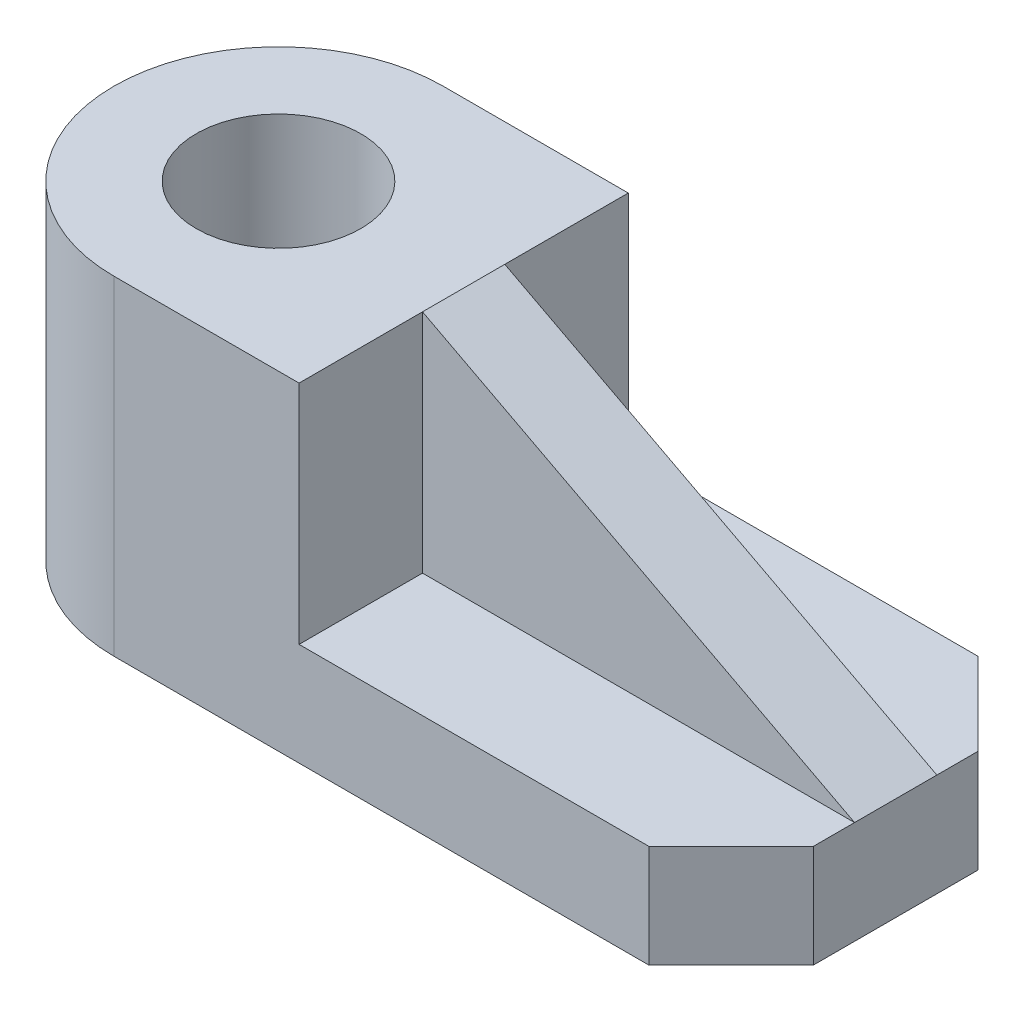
ISO-10303-21;
HEADER;
FILE_DESCRIPTION(('STEP AP214'),'2;1');
FILE_NAME('part.step','',(''),(''),'','','');
FILE_SCHEMA(('AUTOMOTIVE_DESIGN { 1 0 10303 214 1 1 1 1 }'));
ENDSEC;
DATA;
#1=APPLICATION_CONTEXT('core data for automotive mechanical design processes');
#2=APPLICATION_PROTOCOL_DEFINITION('international standard','automotive_design',2000,#1);
#3=PRODUCT_CONTEXT('',#1,'mechanical');
#4=PRODUCT('Part','Part','',(#3));
#5=PRODUCT_RELATED_PRODUCT_CATEGORY('part','',(#4));
#6=PRODUCT_DEFINITION_FORMATION('','',#4);
#7=PRODUCT_DEFINITION_CONTEXT('part definition',#1,'design');
#8=PRODUCT_DEFINITION('design','',#6,#7);
#9=PRODUCT_DEFINITION_SHAPE('','',#8);
#10=(LENGTH_UNIT() NAMED_UNIT(*) SI_UNIT(.MILLI.,.METRE.));
#11=(NAMED_UNIT(*) PLANE_ANGLE_UNIT() SI_UNIT($,.RADIAN.));
#12=(NAMED_UNIT(*) SI_UNIT($,.STERADIAN.) SOLID_ANGLE_UNIT());
#13=UNCERTAINTY_MEASURE_WITH_UNIT(LENGTH_MEASURE(1.E-05),#10,'distance_accuracy_value','');
#14=(GEOMETRIC_REPRESENTATION_CONTEXT(3) GLOBAL_UNCERTAINTY_ASSIGNED_CONTEXT((#13)) GLOBAL_UNIT_ASSIGNED_CONTEXT((#10,
#11,#12)) REPRESENTATION_CONTEXT('',''));
#15=CARTESIAN_POINT('',(0.,0.,0.));
#16=DIRECTION('',(0.,0.,1.));
#17=DIRECTION('',(1.,0.,0.));
#18=AXIS2_PLACEMENT_3D('',#15,#16,#17);
#19=CARTESIAN_POINT('',(0.,10.,0.));
#20=DIRECTION('',(0.,-1.,0.));
#21=DIRECTION('',(0.,0.,-1.));
#22=AXIS2_PLACEMENT_3D('',#19,#20,#21);
#23=PLANE('',#22);
#24=DIRECTION('',(0.,0.,-1.));
#25=VECTOR('',#24,1.);
#26=CARTESIAN_POINT('',(60.,10.,-16.));
#27=LINE('',#26,#25);
#28=CARTESIAN_POINT('',(60.,10.,-4.));
#29=VERTEX_POINT('',#28);
#30=CARTESIAN_POINT('',(60.,10.,-7.99999999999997));
#31=VERTEX_POINT('',#30);
#32=EDGE_CURVE('E158',#29,#31,#27,.T.);
#33=ORIENTED_EDGE('',*,*,#32,.T.);
#34=DIRECTION('',(0.707106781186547,0.,0.707106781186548));
#35=VECTOR('',#34,1.);
#36=CARTESIAN_POINT('',(52.,10.,-16.));
#37=LINE('',#36,#35);
#38=CARTESIAN_POINT('',(52.,10.,-16.));
#39=VERTEX_POINT('',#38);
#40=EDGE_CURVE('E218',#31,#39,#37,.F.);
#41=ORIENTED_EDGE('',*,*,#40,.T.);
#42=DIRECTION('',(-1.,0.,0.));
#43=VECTOR('',#42,1.);
#44=CARTESIAN_POINT('',(0.,10.,-16.));
#45=LINE('',#44,#43);
#46=CARTESIAN_POINT('',(18.,10.,-16.));
#47=VERTEX_POINT('',#46);
#48=EDGE_CURVE('E175',#39,#47,#45,.T.);
#49=ORIENTED_EDGE('',*,*,#48,.T.);
#50=DIRECTION('',(0.,0.,-1.));
#51=VECTOR('',#50,1.);
#52=CARTESIAN_POINT('',(18.,10.,-16.));
#53=LINE('',#52,#51);
#54=CARTESIAN_POINT('',(18.,10.,-4.));
#55=VERTEX_POINT('',#54);
#56=EDGE_CURVE('E161',#55,#47,#53,.T.);
#57=ORIENTED_EDGE('',*,*,#56,.F.);
#58=DIRECTION('',(-1.,0.,0.));
#59=VECTOR('',#58,1.);
#60=CARTESIAN_POINT('',(0.,10.,-4.));
#61=LINE('',#60,#59);
#62=EDGE_CURVE('E149',#29,#55,#61,.T.);
#63=ORIENTED_EDGE('',*,*,#62,.F.);
#64=EDGE_LOOP('',(#33,#41,#49,#57,#63));
#65=FACE_BOUND('',#64,.T.);
#66=ADVANCED_FACE('F49',(#65),#23,.F.);
#67=CARTESIAN_POINT('',(18.,32.,-16.));
#68=DIRECTION('',(-1.,0.,0.));
#69=DIRECTION('',(0.,0.,1.));
#70=AXIS2_PLACEMENT_3D('',#67,#68,#69);
#71=PLANE('',#70);
#72=DIRECTION('',(0.,1.,0.));
#73=VECTOR('',#72,1.);
#74=CARTESIAN_POINT('',(18.,32.,-4.));
#75=LINE('',#74,#73);
#76=CARTESIAN_POINT('',(18.,32.,-4.));
#77=VERTEX_POINT('',#76);
#78=EDGE_CURVE('E151',#55,#77,#75,.T.);
#79=ORIENTED_EDGE('',*,*,#78,.F.);
#80=ORIENTED_EDGE('',*,*,#56,.T.);
#81=DIRECTION('',(0.,-1.,0.));
#82=VECTOR('',#81,1.);
#83=CARTESIAN_POINT('',(18.,32.,-16.));
#84=LINE('',#83,#82);
#85=CARTESIAN_POINT('',(18.,32.,-16.));
#86=VERTEX_POINT('',#85);
#87=EDGE_CURVE('E230',#86,#47,#84,.T.);
#88=ORIENTED_EDGE('',*,*,#87,.F.);
#89=DIRECTION('',(0.,0.,-1.));
#90=VECTOR('',#89,1.);
#91=CARTESIAN_POINT('',(18.,32.,-16.));
#92=LINE('',#91,#90);
#93=EDGE_CURVE('E254',#77,#86,#92,.T.);
#94=ORIENTED_EDGE('',*,*,#93,.F.);
#95=EDGE_LOOP('',(#79,#80,#88,#94));
#96=FACE_BOUND('',#95,.T.);
#97=ADVANCED_FACE('F310',(#96),#71,.F.);
#98=DIRECTION('',(1.,0.,0.));
#99=VECTOR('',#98,1.);
#100=CARTESIAN_POINT('',(60.,10.,16.));
#101=LINE('',#100,#99);
#102=CARTESIAN_POINT('',(18.,10.,16.));
#103=VERTEX_POINT('',#102);
#104=CARTESIAN_POINT('',(52.,10.,16.));
#105=VERTEX_POINT('',#104);
#106=EDGE_CURVE('E171',#103,#105,#101,.T.);
#107=ORIENTED_EDGE('',*,*,#106,.T.);
#108=DIRECTION('',(-0.707106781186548,0.,0.707106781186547));
#109=VECTOR('',#108,1.);
#110=CARTESIAN_POINT('',(60.,10.,7.99999999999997));
#111=LINE('',#110,#109);
#112=CARTESIAN_POINT('',(60.,10.,7.99999999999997));
#113=VERTEX_POINT('',#112);
#114=EDGE_CURVE('E11',#105,#113,#111,.F.);
#115=ORIENTED_EDGE('',*,*,#114,.T.);
#116=CARTESIAN_POINT('',(60.,10.,4.));
#117=VERTEX_POINT('',#116);
#118=EDGE_CURVE('E170',#113,#117,#27,.T.);
#119=ORIENTED_EDGE('',*,*,#118,.T.);
#120=DIRECTION('',(-1.,0.,0.));
#121=VECTOR('',#120,1.);
#122=CARTESIAN_POINT('',(0.,10.,4.));
#123=LINE('',#122,#121);
#124=CARTESIAN_POINT('',(18.,10.,4.));
#125=VERTEX_POINT('',#124);
#126=EDGE_CURVE('E144',#117,#125,#123,.T.);
#127=ORIENTED_EDGE('',*,*,#126,.T.);
#128=EDGE_CURVE('E265',#103,#125,#53,.T.);
#129=ORIENTED_EDGE('',*,*,#128,.F.);
#130=EDGE_LOOP('',(#107,#115,#119,#127,#129));
#131=FACE_BOUND('',#130,.T.);
#132=ADVANCED_FACE('F274',(#131),#23,.F.);
#133=CARTESIAN_POINT('',(0.,10.,0.));
#134=DIRECTION('',(0.,-1.,0.));
#135=DIRECTION('',(0.,0.,-1.));
#136=AXIS2_PLACEMENT_3D('',#133,#134,#135);
#137=CYLINDRICAL_SURFACE('',#136,16.);
#138=DIRECTION('',(0.,-1.,0.));
#139=VECTOR('',#138,1.);
#140=CARTESIAN_POINT('',(0.,10.,16.));
#141=LINE('',#140,#139);
#142=CARTESIAN_POINT('',(0.,32.,16.));
#143=VERTEX_POINT('',#142);
#144=CARTESIAN_POINT('',(0.,0.,16.));
#145=VERTEX_POINT('',#144);
#146=EDGE_CURVE('E198',#143,#145,#141,.T.);
#147=ORIENTED_EDGE('',*,*,#146,.F.);
#148=CARTESIAN_POINT('',(0.,32.,0.));
#149=DIRECTION('',(0.,1.,0.));
#150=DIRECTION('',(0.,0.,-1.));
#151=AXIS2_PLACEMENT_3D('',#148,#149,#150);
#152=CIRCLE('',#151,16.);
#153=CARTESIAN_POINT('',(0.,32.,-16.));
#154=VERTEX_POINT('',#153);
#155=EDGE_CURVE('E247',#154,#143,#152,.T.);
#156=ORIENTED_EDGE('',*,*,#155,.F.);
#157=DIRECTION('',(0.,-1.,0.));
#158=VECTOR('',#157,1.);
#159=CARTESIAN_POINT('',(0.,10.,-16.));
#160=LINE('',#159,#158);
#161=CARTESIAN_POINT('',(0.,0.,-16.));
#162=VERTEX_POINT('',#161);
#163=EDGE_CURVE('E182',#154,#162,#160,.T.);
#164=ORIENTED_EDGE('',*,*,#163,.T.);
#165=CARTESIAN_POINT('',(0.,0.,0.));
#166=DIRECTION('',(0.,1.,0.));
#167=DIRECTION('',(0.,0.,-1.));
#168=AXIS2_PLACEMENT_3D('',#165,#166,#167);
#169=CIRCLE('',#168,16.);
#170=EDGE_CURVE('E183',#162,#145,#169,.T.);
#171=ORIENTED_EDGE('',*,*,#170,.T.);
#172=EDGE_LOOP('',(#147,#156,#164,#171));
#173=FACE_BOUND('',#172,.T.);
#174=ADVANCED_FACE('F246',(#173),#137,.T.);
#175=CARTESIAN_POINT('',(60.,10.,16.));
#176=DIRECTION('',(0.,0.,-1.));
#177=DIRECTION('',(-1.,0.,0.));
#178=AXIS2_PLACEMENT_3D('',#175,#176,#177);
#179=PLANE('',#178);
#180=DIRECTION('',(1.,0.,0.));
#181=VECTOR('',#180,1.);
#182=CARTESIAN_POINT('',(60.,0.,16.));
#183=LINE('',#182,#181);
#184=CARTESIAN_POINT('',(52.,0.,16.));
#185=VERTEX_POINT('',#184);
#186=EDGE_CURVE('E186',#145,#185,#183,.T.);
#187=ORIENTED_EDGE('',*,*,#186,.T.);
#188=DIRECTION('',(0.,1.,0.));
#189=VECTOR('',#188,1.);
#190=CARTESIAN_POINT('',(52.,10.,16.));
#191=LINE('',#190,#189);
#192=EDGE_CURVE('E59',#185,#105,#191,.T.);
#193=ORIENTED_EDGE('',*,*,#192,.T.);
#194=ORIENTED_EDGE('',*,*,#106,.F.);
#195=DIRECTION('',(0.,-1.,0.));
#196=VECTOR('',#195,1.);
#197=CARTESIAN_POINT('',(18.,32.,16.));
#198=LINE('',#197,#196);
#199=CARTESIAN_POINT('',(18.,32.,16.));
#200=VERTEX_POINT('',#199);
#201=EDGE_CURVE('E187',#200,#103,#198,.T.);
#202=ORIENTED_EDGE('',*,*,#201,.F.);
#203=DIRECTION('',(1.,0.,0.));
#204=VECTOR('',#203,1.);
#205=CARTESIAN_POINT('',(18.,32.,16.));
#206=LINE('',#205,#204);
#207=EDGE_CURVE('E243',#143,#200,#206,.T.);
#208=ORIENTED_EDGE('',*,*,#207,.F.);
#209=ORIENTED_EDGE('',*,*,#146,.T.);
#210=EDGE_LOOP('',(#187,#193,#194,#202,#208,#209));
#211=FACE_BOUND('',#210,.T.);
#212=ADVANCED_FACE('F239',(#211),#179,.F.);
#213=CARTESIAN_POINT('',(60.,10.,-16.));
#214=DIRECTION('',(-1.,0.,0.));
#215=DIRECTION('',(0.,0.,1.));
#216=AXIS2_PLACEMENT_3D('',#213,#214,#215);
#217=PLANE('',#216);
#218=DIRECTION('',(0.,0.,-1.));
#219=VECTOR('',#218,1.);
#220=CARTESIAN_POINT('',(60.,0.,-16.));
#221=LINE('',#220,#219);
#222=CARTESIAN_POINT('',(60.,0.,7.99999999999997));
#223=VERTEX_POINT('',#222);
#224=CARTESIAN_POINT('',(60.,0.,-7.99999999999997));
#225=VERTEX_POINT('',#224);
#226=EDGE_CURVE('E190',#223,#225,#221,.T.);
#227=ORIENTED_EDGE('',*,*,#226,.T.);
#228=DIRECTION('',(0.,1.,0.));
#229=VECTOR('',#228,1.);
#230=CARTESIAN_POINT('',(60.,10.,-7.99999999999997));
#231=LINE('',#230,#229);
#232=EDGE_CURVE('E168',#225,#31,#231,.T.);
#233=ORIENTED_EDGE('',*,*,#232,.T.);
#234=ORIENTED_EDGE('',*,*,#32,.F.);
#235=DIRECTION('',(0.,0.,1.));
#236=VECTOR('',#235,1.);
#237=CARTESIAN_POINT('',(60.,10.,-16.));
#238=LINE('',#237,#236);
#239=EDGE_CURVE('E133',#117,#29,#238,.F.);
#240=ORIENTED_EDGE('',*,*,#239,.F.);
#241=ORIENTED_EDGE('',*,*,#118,.F.);
#242=DIRECTION('',(0.,-1.,0.));
#243=VECTOR('',#242,1.);
#244=CARTESIAN_POINT('',(60.,10.,7.99999999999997));
#245=LINE('',#244,#243);
#246=EDGE_CURVE('E212',#113,#223,#245,.T.);
#247=ORIENTED_EDGE('',*,*,#246,.T.);
#248=EDGE_LOOP('',(#227,#233,#234,#240,#241,#247));
#249=FACE_BOUND('',#248,.T.);
#250=ADVANCED_FACE('F166',(#249),#217,.F.);
#251=CARTESIAN_POINT('',(0.,10.,-16.));
#252=DIRECTION('',(0.,0.,1.));
#253=DIRECTION('',(1.,0.,0.));
#254=AXIS2_PLACEMENT_3D('',#251,#252,#253);
#255=PLANE('',#254);
#256=ORIENTED_EDGE('',*,*,#48,.F.);
#257=DIRECTION('',(0.,-1.,0.));
#258=VECTOR('',#257,1.);
#259=CARTESIAN_POINT('',(52.,10.,-16.));
#260=LINE('',#259,#258);
#261=CARTESIAN_POINT('',(52.,0.,-16.));
#262=VERTEX_POINT('',#261);
#263=EDGE_CURVE('E202',#39,#262,#260,.T.);
#264=ORIENTED_EDGE('',*,*,#263,.T.);
#265=DIRECTION('',(-1.,0.,0.));
#266=VECTOR('',#265,1.);
#267=CARTESIAN_POINT('',(0.,0.,-16.));
#268=LINE('',#267,#266);
#269=EDGE_CURVE('E176',#262,#162,#268,.T.);
#270=ORIENTED_EDGE('',*,*,#269,.T.);
#271=ORIENTED_EDGE('',*,*,#163,.F.);
#272=DIRECTION('',(-1.,0.,0.));
#273=VECTOR('',#272,1.);
#274=CARTESIAN_POINT('',(0.,32.,-16.));
#275=LINE('',#274,#273);
#276=EDGE_CURVE('E249',#86,#154,#275,.T.);
#277=ORIENTED_EDGE('',*,*,#276,.F.);
#278=ORIENTED_EDGE('',*,*,#87,.T.);
#279=EDGE_LOOP('',(#256,#264,#270,#271,#277,#278));
#280=FACE_BOUND('',#279,.T.);
#281=ADVANCED_FACE('F226',(#280),#255,.F.);
#282=CARTESIAN_POINT('',(0.,0.,0.));
#283=DIRECTION('',(0.,-1.,0.));
#284=DIRECTION('',(0.,0.,-1.));
#285=AXIS2_PLACEMENT_3D('',#282,#283,#284);
#286=PLANE('',#285);
#287=CARTESIAN_POINT('',(0.,0.,0.));
#288=DIRECTION('',(0.,1.,0.));
#289=DIRECTION('',(0.,0.,1.));
#290=AXIS2_PLACEMENT_3D('',#287,#288,#289);
#291=CIRCLE('',#290,8.);
#292=CARTESIAN_POINT('',(0.,0.,8.));
#293=VERTEX_POINT('',#292);
#294=EDGE_CURVE('E283',#293,#293,#291,.T.);
#295=ORIENTED_EDGE('',*,*,#294,.T.);
#296=EDGE_LOOP('',(#295));
#297=FACE_BOUND('',#296,.T.);
#298=ORIENTED_EDGE('',*,*,#269,.F.);
#299=DIRECTION('',(-0.707106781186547,0.,-0.707106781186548));
#300=VECTOR('',#299,1.);
#301=CARTESIAN_POINT('',(34.,0.,-34.));
#302=LINE('',#301,#300);
#303=EDGE_CURVE('E209',#262,#225,#302,.F.);
#304=ORIENTED_EDGE('',*,*,#303,.T.);
#305=ORIENTED_EDGE('',*,*,#226,.F.);
#306=DIRECTION('',(0.707106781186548,0.,-0.707106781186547));
#307=VECTOR('',#306,1.);
#308=CARTESIAN_POINT('',(33.9999999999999,0.,34.));
#309=LINE('',#308,#307);
#310=EDGE_CURVE('E206',#223,#185,#309,.F.);
#311=ORIENTED_EDGE('',*,*,#310,.T.);
#312=ORIENTED_EDGE('',*,*,#186,.F.);
#313=ORIENTED_EDGE('',*,*,#170,.F.);
#314=EDGE_LOOP('',(#298,#304,#305,#311,#312,#313));
#315=FACE_BOUND('',#314,.T.);
#316=ADVANCED_FACE('F234',(#297,#315),#286,.T.);
#317=ORIENTED_EDGE('',*,*,#128,.T.);
#318=DIRECTION('',(0.,1.,0.));
#319=VECTOR('',#318,1.);
#320=CARTESIAN_POINT('',(18.,32.,4.));
#321=LINE('',#320,#319);
#322=CARTESIAN_POINT('',(18.,32.,4.));
#323=VERTEX_POINT('',#322);
#324=EDGE_CURVE('E163',#125,#323,#321,.T.);
#325=ORIENTED_EDGE('',*,*,#324,.T.);
#326=EDGE_CURVE('E256',#200,#323,#92,.T.);
#327=ORIENTED_EDGE('',*,*,#326,.F.);
#328=ORIENTED_EDGE('',*,*,#201,.T.);
#329=EDGE_LOOP('',(#317,#325,#327,#328));
#330=FACE_BOUND('',#329,.T.);
#331=ADVANCED_FACE('F272',(#330),#71,.F.);
#332=CARTESIAN_POINT('',(0.,32.,0.));
#333=DIRECTION('',(0.,-1.,0.));
#334=DIRECTION('',(0.,0.,-1.));
#335=AXIS2_PLACEMENT_3D('',#332,#333,#334);
#336=PLANE('',#335);
#337=CARTESIAN_POINT('',(0.,32.,0.));
#338=DIRECTION('',(0.,1.,0.));
#339=DIRECTION('',(0.,0.,1.));
#340=AXIS2_PLACEMENT_3D('',#337,#338,#339);
#341=CIRCLE('',#340,8.);
#342=CARTESIAN_POINT('',(0.,32.,8.));
#343=VERTEX_POINT('',#342);
#344=EDGE_CURVE('E143',#343,#343,#341,.T.);
#345=ORIENTED_EDGE('',*,*,#344,.F.);
#346=EDGE_LOOP('',(#345));
#347=FACE_BOUND('',#346,.T.);
#348=ORIENTED_EDGE('',*,*,#326,.T.);
#349=EDGE_CURVE('E261',#323,#77,#92,.T.);
#350=ORIENTED_EDGE('',*,*,#349,.T.);
#351=ORIENTED_EDGE('',*,*,#93,.T.);
#352=ORIENTED_EDGE('',*,*,#276,.T.);
#353=ORIENTED_EDGE('',*,*,#155,.T.);
#354=ORIENTED_EDGE('',*,*,#207,.T.);
#355=EDGE_LOOP('',(#348,#350,#351,#352,#353,#354));
#356=FACE_BOUND('',#355,.T.);
#357=ADVANCED_FACE('F252',(#347,#356),#336,.F.);
#358=CARTESIAN_POINT('',(0.,0.,0.));
#359=DIRECTION('',(0.,1.,0.));
#360=DIRECTION('',(0.,0.,1.));
#361=AXIS2_PLACEMENT_3D('',#358,#359,#360);
#362=CYLINDRICAL_SURFACE('',#361,8.);
#363=ORIENTED_EDGE('',*,*,#294,.F.);
#364=EDGE_LOOP('',(#363));
#365=FACE_BOUND('',#364,.T.);
#366=ORIENTED_EDGE('',*,*,#344,.T.);
#367=EDGE_LOOP('',(#366));
#368=FACE_BOUND('',#367,.T.);
#369=ADVANCED_FACE('F300',(#365,#368),#362,.F.);
#370=CARTESIAN_POINT('',(22.,16.,4.));
#371=DIRECTION('',(0.,0.,1.));
#372=DIRECTION('',(1.,0.,0.));
#373=AXIS2_PLACEMENT_3D('',#370,#371,#372);
#374=PLANE('',#373);
#375=ORIENTED_EDGE('',*,*,#126,.F.);
#376=DIRECTION('',(0.885831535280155,-0.464006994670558,0.));
#377=VECTOR('',#376,1.);
#378=CARTESIAN_POINT('',(18.,32.,4.));
#379=LINE('',#378,#377);
#380=EDGE_CURVE('E139',#323,#117,#379,.T.);
#381=ORIENTED_EDGE('',*,*,#380,.F.);
#382=ORIENTED_EDGE('',*,*,#324,.F.);
#383=EDGE_LOOP('',(#375,#381,#382));
#384=FACE_BOUND('',#383,.T.);
#385=ADVANCED_FACE('F294',(#384),#374,.T.);
#386=CARTESIAN_POINT('',(22.,16.,-4.));
#387=DIRECTION('',(0.,0.,1.));
#388=DIRECTION('',(1.,0.,0.));
#389=AXIS2_PLACEMENT_3D('',#386,#387,#388);
#390=PLANE('',#389);
#391=DIRECTION('',(0.885831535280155,-0.464006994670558,0.));
#392=VECTOR('',#391,1.);
#393=CARTESIAN_POINT('',(18.,32.,-4.));
#394=LINE('',#393,#392);
#395=EDGE_CURVE('E136',#77,#29,#394,.T.);
#396=ORIENTED_EDGE('',*,*,#395,.T.);
#397=ORIENTED_EDGE('',*,*,#62,.T.);
#398=ORIENTED_EDGE('',*,*,#78,.T.);
#399=EDGE_LOOP('',(#396,#397,#398));
#400=FACE_BOUND('',#399,.T.);
#401=ADVANCED_FACE('F148',(#400),#390,.F.);
#402=CARTESIAN_POINT('',(18.,32.,0.));
#403=DIRECTION('',(-0.464006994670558,-0.885831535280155,0.));
#404=DIRECTION('',(0.885831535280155,-0.464006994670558,0.));
#405=AXIS2_PLACEMENT_3D('',#402,#403,#404);
#406=PLANE('',#405);
#407=ORIENTED_EDGE('',*,*,#380,.T.);
#408=ORIENTED_EDGE('',*,*,#239,.T.);
#409=ORIENTED_EDGE('',*,*,#395,.F.);
#410=ORIENTED_EDGE('',*,*,#349,.F.);
#411=EDGE_LOOP('',(#407,#408,#409,#410));
#412=FACE_BOUND('',#411,.T.);
#413=ADVANCED_FACE('F135',(#412),#406,.F.);
#414=CARTESIAN_POINT('',(52.,10.,-16.));
#415=DIRECTION('',(-0.707106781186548,0.,0.707106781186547));
#416=DIRECTION('',(0.,-1.,0.));
#417=AXIS2_PLACEMENT_3D('',#414,#415,#416);
#418=PLANE('',#417);
#419=ORIENTED_EDGE('',*,*,#40,.F.);
#420=ORIENTED_EDGE('',*,*,#232,.F.);
#421=ORIENTED_EDGE('',*,*,#303,.F.);
#422=ORIENTED_EDGE('',*,*,#263,.F.);
#423=EDGE_LOOP('',(#419,#420,#421,#422));
#424=FACE_BOUND('',#423,.T.);
#425=ADVANCED_FACE('F231',(#424),#418,.F.);
#426=CARTESIAN_POINT('',(60.,10.,7.99999999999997));
#427=DIRECTION('',(-0.707106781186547,0.,-0.707106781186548));
#428=DIRECTION('',(0.,-1.,0.));
#429=AXIS2_PLACEMENT_3D('',#426,#427,#428);
#430=PLANE('',#429);
#431=ORIENTED_EDGE('',*,*,#114,.F.);
#432=ORIENTED_EDGE('',*,*,#192,.F.);
#433=ORIENTED_EDGE('',*,*,#310,.F.);
#434=ORIENTED_EDGE('',*,*,#246,.F.);
#435=EDGE_LOOP('',(#431,#432,#433,#434));
#436=FACE_BOUND('',#435,.T.);
#437=ADVANCED_FACE('F52',(#436),#430,.F.);
#438=CLOSED_SHELL('',(#66,#97,#132,#174,#212,#250,#281,#316,#331,#357,#369,#385,#401,#413,#425,#437));
#439=MANIFOLD_SOLID_BREP('B2',#438);
#440=ADVANCED_BREP_SHAPE_REPRESENTATION('',(#18,#439),#14);
#441=SHAPE_DEFINITION_REPRESENTATION(#9,#440);
ENDSEC;
END-ISO-10303-21;
